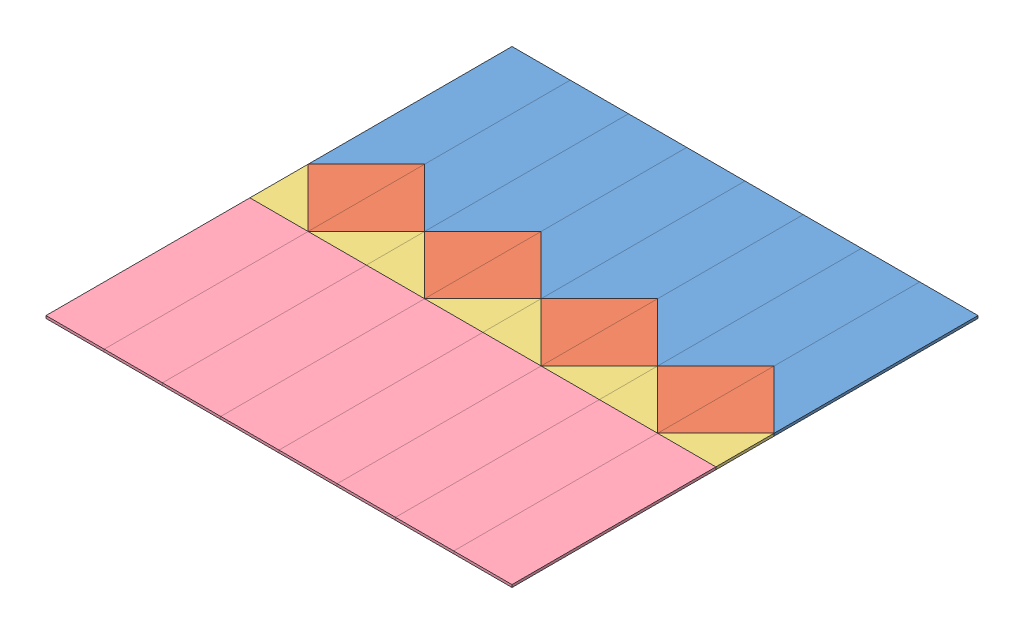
SolidWorks assembly Assem2.sldasm, configuration Default (file format 14000). Lengths in mm.
Overall size (184 1 184).
36 component instances, 4 part files, 6 mates.
Components (placement in the parent):
- Assem1-1: Assem1.SLDASM [Default] at (-6.3108 51.4309 47.0969) size (46 1 184)
  - Boss-Extrude2-1: Boss-Extrude2.SLDPRT [Default] at (6.7823 44.795 209.5172) size (23 1 80.5)
  - Boss-Extrude3-1: Boss-Extrude3.SLDPRT [Default] at (6.7823 44.795 209.5172) size (23 1 46)
  - Boss-Extrude5-1: Boss-Extrude5.SLDPRT [Default] at (6.7823 44.795 209.5172) size (23 1 23)
  - Boss-Extrude6-1: Boss-Extrude6.SLDPRT [Default] at (6.7823 44.795 209.5172) size (23 1 80.5)
  - Boss-Extrude2-2: Boss-Extrude2.SLDPRT [Default] at (52.7823 45.795 209.5172) x (-1 0 0) z (0 0 1) size (23 1 80.5)
  - Boss-Extrude3-2: Boss-Extrude3.SLDPRT [Default] at (52.7823 45.795 209.5172) x (-1 0 0) z (0 0 1) size (23 1 46)
  - Boss-Extrude5-2: Boss-Extrude5.SLDPRT [Default] at (52.7823 45.795 209.5172) x (-1 0 0) z (0 0 1) size (23 1 23)
  - Boss-Extrude6-2: Boss-Extrude6.SLDPRT [Default] at (29.7823 44.795 209.5172) size (23 1 80.5)
- Assem1-2: Assem1.SLDASM [Default] at (39.6892 51.4309 47.0969) size (46 1 184)
  - Boss-Extrude2-1: Boss-Extrude2.SLDPRT [Default] at (6.7823 44.795 209.5172) size (23 1 80.5)
  - Boss-Extrude3-1: Boss-Extrude3.SLDPRT [Default] at (6.7823 44.795 209.5172) size (23 1 46)
  - Boss-Extrude5-1: Boss-Extrude5.SLDPRT [Default] at (6.7823 44.795 209.5172) size (23 1 23)
  - Boss-Extrude6-1: Boss-Extrude6.SLDPRT [Default] at (6.7823 44.795 209.5172) size (23 1 80.5)
  - Boss-Extrude2-2: Boss-Extrude2.SLDPRT [Default] at (52.7823 45.795 209.5172) x (-1 0 0) z (0 0 1) size (23 1 80.5)
  - Boss-Extrude3-2: Boss-Extrude3.SLDPRT [Default] at (52.7823 45.795 209.5172) x (-1 0 0) z (0 0 1) size (23 1 46)
  - Boss-Extrude5-2: Boss-Extrude5.SLDPRT [Default] at (52.7823 45.795 209.5172) x (-1 0 0) z (0 0 1) size (23 1 23)
  - Boss-Extrude6-2: Boss-Extrude6.SLDPRT [Default] at (29.7823 44.795 209.5172) size (23 1 80.5)
- Assem1-3: Assem1.SLDASM [Default] at (85.6892 51.4309 47.0969) size (46 1 184)
  - Boss-Extrude2-1: Boss-Extrude2.SLDPRT [Default] at (6.7823 44.795 209.5172) size (23 1 80.5)
  - Boss-Extrude3-1: Boss-Extrude3.SLDPRT [Default] at (6.7823 44.795 209.5172) size (23 1 46)
  - Boss-Extrude5-1: Boss-Extrude5.SLDPRT [Default] at (6.7823 44.795 209.5172) size (23 1 23)
  - Boss-Extrude6-1: Boss-Extrude6.SLDPRT [Default] at (6.7823 44.795 209.5172) size (23 1 80.5)
  - Boss-Extrude2-2: Boss-Extrude2.SLDPRT [Default] at (52.7823 45.795 209.5172) x (-1 0 0) z (0 0 1) size (23 1 80.5)
  - Boss-Extrude3-2: Boss-Extrude3.SLDPRT [Default] at (52.7823 45.795 209.5172) x (-1 0 0) z (0 0 1) size (23 1 46)
  - Boss-Extrude5-2: Boss-Extrude5.SLDPRT [Default] at (52.7823 45.795 209.5172) x (-1 0 0) z (0 0 1) size (23 1 23)
  - Boss-Extrude6-2: Boss-Extrude6.SLDPRT [Default] at (29.7823 44.795 209.5172) size (23 1 80.5)
- Assem1-4: Assem1.SLDASM [Default] at (131.6892 51.4309 47.0969) size (46 1 184)
  - Boss-Extrude2-1: Boss-Extrude2.SLDPRT [Default] at (6.7823 44.795 209.5172) size (23 1 80.5)
  - Boss-Extrude3-1: Boss-Extrude3.SLDPRT [Default] at (6.7823 44.795 209.5172) size (23 1 46)
  - Boss-Extrude5-1: Boss-Extrude5.SLDPRT [Default] at (6.7823 44.795 209.5172) size (23 1 23)
  - Boss-Extrude6-1: Boss-Extrude6.SLDPRT [Default] at (6.7823 44.795 209.5172) size (23 1 80.5)
  - Boss-Extrude2-2: Boss-Extrude2.SLDPRT [Default] at (52.7823 45.795 209.5172) x (-1 0 0) z (0 0 1) size (23 1 80.5)
  - Boss-Extrude3-2: Boss-Extrude3.SLDPRT [Default] at (52.7823 45.795 209.5172) x (-1 0 0) z (0 0 1) size (23 1 46)
  - Boss-Extrude5-2: Boss-Extrude5.SLDPRT [Default] at (52.7823 45.795 209.5172) x (-1 0 0) z (0 0 1) size (23 1 23)
  - Boss-Extrude6-2: Boss-Extrude6.SLDPRT [Default] at (29.7823 44.795 209.5172) size (23 1 80.5)
Mates (geometry in assembly coordinates):
- Coincident2: coincident aligned: line of Assem1-1/Boss-Extrude2-2 through (46.4714 97.2259 153.1142) axis (0 0 -1); line of Assem1-2/Boss-Extrude2-1 through (46.4714 97.2259 153.1142) axis (0 0 -1)
- Coincident3: coincident: point of Assem1-1/Boss-Extrude2-2; point of Assem1-2/Boss-Extrude2-1
- Coincident4: coincident aligned: line of Assem1-2/Boss-Extrude2-2 through (92.4714 97.2259 153.1142) axis (0 0 -1); line of Assem1-3/Boss-Extrude2-1 through (92.4714 97.2259 153.1142) axis (0 0 -1)
- Coincident5: coincident: point of Assem1-2/Boss-Extrude2-2; point of Assem1-3/Boss-Extrude2-1
- Coincident6: coincident aligned: line of Assem1-3/Boss-Extrude2-2 through (138.4714 97.2259 153.1142) axis (0 0 -1); line of Assem1-4/Boss-Extrude2-1 through (138.4714 97.2259 153.1142) axis (0 0 -1)
- Coincident7: coincident: point of Assem1-3/Boss-Extrude2-2; point of Assem1-4/Boss-Extrude2-1
